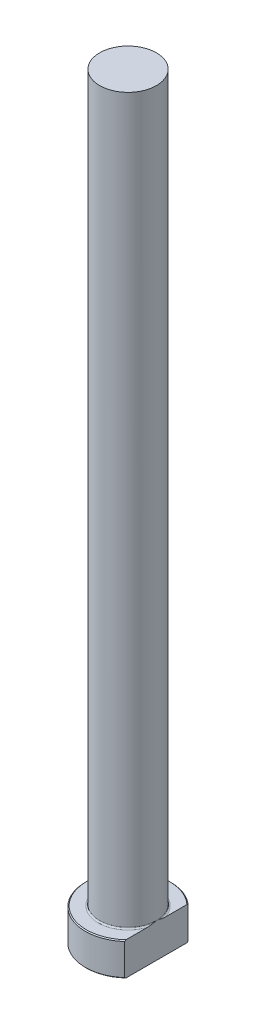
ISO-10303-21;
HEADER;
FILE_DESCRIPTION(('STEP AP214'),'2;1');
FILE_NAME('part.step','',(''),(''),'','','');
FILE_SCHEMA(('AUTOMOTIVE_DESIGN { 1 0 10303 214 1 1 1 1 }'));
ENDSEC;
DATA;
#1=APPLICATION_CONTEXT('core data for automotive mechanical design processes');
#2=APPLICATION_PROTOCOL_DEFINITION('international standard','automotive_design',2000,#1);
#3=PRODUCT_CONTEXT('',#1,'mechanical');
#4=PRODUCT('Part','Part','',(#3));
#5=PRODUCT_RELATED_PRODUCT_CATEGORY('part','',(#4));
#6=PRODUCT_DEFINITION_FORMATION('','',#4);
#7=PRODUCT_DEFINITION_CONTEXT('part definition',#1,'design');
#8=PRODUCT_DEFINITION('design','',#6,#7);
#9=PRODUCT_DEFINITION_SHAPE('','',#8);
#10=(LENGTH_UNIT() NAMED_UNIT(*) SI_UNIT(.MILLI.,.METRE.));
#11=(NAMED_UNIT(*) PLANE_ANGLE_UNIT() SI_UNIT($,.RADIAN.));
#12=(NAMED_UNIT(*) SI_UNIT($,.STERADIAN.) SOLID_ANGLE_UNIT());
#13=UNCERTAINTY_MEASURE_WITH_UNIT(LENGTH_MEASURE(1.E-05),#10,'distance_accuracy_value','');
#14=(GEOMETRIC_REPRESENTATION_CONTEXT(3) GLOBAL_UNCERTAINTY_ASSIGNED_CONTEXT((#13)) GLOBAL_UNIT_ASSIGNED_CONTEXT((#10,
#11,#12)) REPRESENTATION_CONTEXT('',''));
#15=CARTESIAN_POINT('',(0.,0.,0.));
#16=DIRECTION('',(0.,0.,1.));
#17=DIRECTION('',(1.,0.,0.));
#18=AXIS2_PLACEMENT_3D('',#15,#16,#17);
#19=CARTESIAN_POINT('',(0.,0.,0.));
#20=DIRECTION('',(0.,-1.,0.));
#21=DIRECTION('',(0.,0.,-1.));
#22=AXIS2_PLACEMENT_3D('',#19,#20,#21);
#23=PLANE('',#22);
#24=CARTESIAN_POINT('',(0.,0.,0.));
#25=DIRECTION('',(0.,-1.,0.));
#26=DIRECTION('',(0.,0.,-1.));
#27=AXIS2_PLACEMENT_3D('',#24,#25,#26);
#28=CIRCLE('',#27,8.79999999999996);
#29=CARTESIAN_POINT('',(5.99999999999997,0.,6.4373907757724));
#30=VERTEX_POINT('',#29);
#31=CARTESIAN_POINT('',(5.99999999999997,0.,-6.4373907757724));
#32=VERTEX_POINT('',#31);
#33=EDGE_CURVE('E98',#30,#32,#28,.T.);
#34=ORIENTED_EDGE('',*,*,#33,.T.);
#35=DIRECTION('',(0.,0.,1.));
#36=VECTOR('',#35,1.);
#37=CARTESIAN_POINT('',(5.99999999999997,0.,-6.70820393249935));
#38=LINE('',#37,#36);
#39=EDGE_CURVE('E83',#32,#30,#38,.T.);
#40=ORIENTED_EDGE('',*,*,#39,.T.);
#41=EDGE_LOOP('',(#34,#40));
#42=FACE_BOUND('',#41,.T.);
#43=ADVANCED_FACE('F32',(#42),#23,.T.);
#44=CARTESIAN_POINT('',(0.,259.958771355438,0.));
#45=DIRECTION('',(0.,1.,0.));
#46=DIRECTION('',(0.,0.,1.));
#47=AXIS2_PLACEMENT_3D('',#44,#45,#46);
#48=CYLINDRICAL_SURFACE('',#47,8.99999999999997);
#49=CARTESIAN_POINT('',(0.,6.80000000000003,0.));
#50=DIRECTION('',(0.,1.,0.));
#51=DIRECTION('',(0.,0.,1.));
#52=AXIS2_PLACEMENT_3D('',#49,#50,#51);
#53=CIRCLE('',#52,8.99999999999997);
#54=CARTESIAN_POINT('',(5.99999999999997,6.80000000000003,6.70820393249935));
#55=VERTEX_POINT('',#54);
#56=CARTESIAN_POINT('',(5.99999999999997,6.80000000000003,-6.70820393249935));
#57=VERTEX_POINT('',#56);
#58=EDGE_CURVE('E104',#55,#57,#53,.F.);
#59=ORIENTED_EDGE('',*,*,#58,.T.);
#60=DIRECTION('',(0.,-1.,0.));
#61=VECTOR('',#60,1.);
#62=CARTESIAN_POINT('',(5.99999999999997,160.,-6.70820393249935));
#63=LINE('',#62,#61);
#64=CARTESIAN_POINT('',(5.99999999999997,0.199999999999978,-6.70820393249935));
#65=VERTEX_POINT('',#64);
#66=EDGE_CURVE('E183',#57,#65,#63,.T.);
#67=ORIENTED_EDGE('',*,*,#66,.T.);
#68=CARTESIAN_POINT('',(0.,0.199999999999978,0.));
#69=DIRECTION('',(0.,-1.,0.));
#70=DIRECTION('',(0.,0.,-1.));
#71=AXIS2_PLACEMENT_3D('',#68,#69,#70);
#72=CIRCLE('',#71,8.99999999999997);
#73=CARTESIAN_POINT('',(5.99999999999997,0.199999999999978,6.70820393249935));
#74=VERTEX_POINT('',#73);
#75=EDGE_CURVE('E100',#65,#74,#72,.F.);
#76=ORIENTED_EDGE('',*,*,#75,.T.);
#77=DIRECTION('',(0.,-1.,0.));
#78=VECTOR('',#77,1.);
#79=CARTESIAN_POINT('',(5.99999999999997,160.,6.70820393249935));
#80=LINE('',#79,#78);
#81=EDGE_CURVE('E93',#55,#74,#80,.T.);
#82=ORIENTED_EDGE('',*,*,#81,.F.);
#83=EDGE_LOOP('',(#59,#67,#76,#82));
#84=FACE_BOUND('',#83,.T.);
#85=ADVANCED_FACE('F158',(#84),#48,.T.);
#86=CARTESIAN_POINT('',(-8.99999999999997,7.,0.));
#87=DIRECTION('',(0.,1.,0.));
#88=DIRECTION('',(0.,0.,1.));
#89=AXIS2_PLACEMENT_3D('',#86,#87,#88);
#90=PLANE('',#89);
#91=CARTESIAN_POINT('',(0.,7.,0.));
#92=DIRECTION('',(0.,1.,0.));
#93=DIRECTION('',(0.,0.,1.));
#94=AXIS2_PLACEMENT_3D('',#91,#92,#93);
#95=CIRCLE('',#94,8.79999999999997);
#96=CARTESIAN_POINT('',(5.99999999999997,7.,-6.43739077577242));
#97=VERTEX_POINT('',#96);
#98=CARTESIAN_POINT('',(5.99999999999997,7.,6.43739077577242));
#99=VERTEX_POINT('',#98);
#100=EDGE_CURVE('E178',#97,#99,#95,.T.);
#101=ORIENTED_EDGE('',*,*,#100,.T.);
#102=DIRECTION('',(0.,0.,-1.));
#103=VECTOR('',#102,1.);
#104=CARTESIAN_POINT('',(5.99999999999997,7.,0.));
#105=LINE('',#104,#103);
#106=CARTESIAN_POINT('',(5.99999999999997,6.99999999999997,1.92093727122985));
#107=VERTEX_POINT('',#106);
#108=EDGE_CURVE('E57',#99,#107,#105,.T.);
#109=ORIENTED_EDGE('',*,*,#108,.T.);
#110=CARTESIAN_POINT('',(0.,7.,0.));
#111=DIRECTION('',(0.,1.,0.));
#112=DIRECTION('',(0.,0.,1.));
#113=AXIS2_PLACEMENT_3D('',#110,#111,#112);
#114=CIRCLE('',#113,6.29999999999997);
#115=CARTESIAN_POINT('',(5.99999999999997,6.99999999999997,-1.92093727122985));
#116=VERTEX_POINT('',#115);
#117=EDGE_CURVE('E107',#107,#116,#114,.F.);
#118=ORIENTED_EDGE('',*,*,#117,.T.);
#119=EDGE_CURVE('E136',#116,#97,#105,.T.);
#120=ORIENTED_EDGE('',*,*,#119,.T.);
#121=EDGE_LOOP('',(#101,#109,#118,#120));
#122=FACE_BOUND('',#121,.T.);
#123=ADVANCED_FACE('F147',(#122),#90,.T.);
#124=CARTESIAN_POINT('',(0.,7.00000000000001,0.));
#125=DIRECTION('',(0.,-1.,0.));
#126=DIRECTION('',(0.,0.,-1.));
#127=AXIS2_PLACEMENT_3D('',#124,#125,#126);
#128=CONICAL_SURFACE('',#127,8.79999999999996,0.785398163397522);
#129=ORIENTED_EDGE('',*,*,#58,.F.);
#130=CARTESIAN_POINT('',(5.99999999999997,-0.132115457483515,14.7591430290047));
#131=CARTESIAN_POINT('',(5.99999999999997,0.0733919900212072,14.537299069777));
#132=CARTESIAN_POINT('',(5.99999999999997,0.278550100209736,14.3151315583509));
#133=CARTESIAN_POINT('',(5.99999999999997,0.688060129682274,13.8700519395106));
#134=CARTESIAN_POINT('',(5.99999999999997,0.89241204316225,13.647139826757));
#135=CARTESIAN_POINT('',(5.99999999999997,1.50418032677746,12.9770492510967));
#136=CARTESIAN_POINT('',(5.99999999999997,1.91022091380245,12.5286117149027));
#137=CARTESIAN_POINT('',(5.99999999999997,2.71980134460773,11.6246427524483));
#138=CARTESIAN_POINT('',(5.99999999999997,3.12331180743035,11.1690849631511));
#139=CARTESIAN_POINT('',(5.99999999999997,3.9234152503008,10.2520077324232));
#140=CARTESIAN_POINT('',(5.99999999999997,4.32000903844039,9.79048899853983));
#141=CARTESIAN_POINT('',(5.99999999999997,5.02478816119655,8.95241885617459));
#142=CARTESIAN_POINT('',(5.99999999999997,5.33476112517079,8.5773777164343));
#143=CARTESIAN_POINT('',(5.99999999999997,5.79310598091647,8.00939108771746));
#144=CARTESIAN_POINT('',(5.99999999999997,5.94480562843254,7.81913145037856));
#145=CARTESIAN_POINT('',(5.99999999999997,6.2455365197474,7.43651727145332));
#146=CARTESIAN_POINT('',(5.99999999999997,6.39456781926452,7.24416277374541));
#147=CARTESIAN_POINT('',(5.99999999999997,6.68925367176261,6.85721540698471));
#148=CARTESIAN_POINT('',(5.99999999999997,6.8349117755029,6.66262524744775));
#149=CARTESIAN_POINT('',(5.99999999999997,7.12230719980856,6.27057707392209));
#150=CARTESIAN_POINT('',(5.99999999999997,7.26404470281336,6.07311919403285));
#151=CARTESIAN_POINT('',(5.99999999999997,7.54263362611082,5.67488713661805));
#152=CARTESIAN_POINT('',(5.99999999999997,7.6794868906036,5.47411425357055));
#153=CARTESIAN_POINT('',(5.99999999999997,7.94714213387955,5.06858845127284));
#154=CARTESIAN_POINT('',(5.99999999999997,8.07794479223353,4.86383598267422));
#155=CARTESIAN_POINT('',(5.99999999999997,8.32827993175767,4.45554322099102));
#156=CARTESIAN_POINT('',(5.99999999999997,8.44802771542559,4.2521356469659));
#157=CARTESIAN_POINT('',(5.99999999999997,8.67837972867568,3.84013730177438));
#158=CARTESIAN_POINT('',(5.99999999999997,8.78898293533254,3.63154595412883));
#159=CARTESIAN_POINT('',(5.99999999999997,8.99840984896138,3.20863811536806));
#160=CARTESIAN_POINT('',(5.99999999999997,9.09724073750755,2.99432521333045));
#161=CARTESIAN_POINT('',(5.99999999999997,9.27991776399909,2.55937061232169));
#162=CARTESIAN_POINT('',(5.99999999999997,9.36376811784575,2.33873071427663));
#163=CARTESIAN_POINT('',(5.99999999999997,9.4962773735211,1.94012294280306));
#164=CARTESIAN_POINT('',(5.99999999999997,9.5486217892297,1.76338731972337));
#165=CARTESIAN_POINT('',(5.99999999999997,9.63978035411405,1.40643307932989));
#166=CARTESIAN_POINT('',(5.99999999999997,9.678596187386,1.22621489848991));
#167=CARTESIAN_POINT('',(5.99999999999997,9.74077317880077,0.863704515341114));
#168=CARTESIAN_POINT('',(5.99999999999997,9.76418479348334,0.681421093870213));
#169=CARTESIAN_POINT('',(5.99999999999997,9.79447814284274,0.315473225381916));
#170=CARTESIAN_POINT('',(5.99999999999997,9.80136083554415,0.131808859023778));
#171=CARTESIAN_POINT('',(5.99999999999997,9.79818788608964,-0.235881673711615));
#172=CARTESIAN_POINT('',(5.99999999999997,9.78808514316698,-0.419907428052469));
#173=CARTESIAN_POINT('',(5.99999999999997,9.75144464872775,-0.786302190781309));
#174=CARTESIAN_POINT('',(5.99999999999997,9.72490559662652,-0.968671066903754));
#175=CARTESIAN_POINT('',(5.99999999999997,9.65670736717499,-1.33110767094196));
#176=CARTESIAN_POINT('',(5.99999999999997,9.61500120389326,-1.51116642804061));
#177=CARTESIAN_POINT('',(5.99999999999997,9.51838325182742,-1.86766519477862));
#178=CARTESIAN_POINT('',(5.99999999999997,9.46347085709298,-2.04410503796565));
#179=CARTESIAN_POINT('',(5.99999999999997,9.3356365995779,-2.41270922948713));
#180=CARTESIAN_POINT('',(5.99999999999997,9.26138327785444,-2.60440790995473));
#181=CARTESIAN_POINT('',(5.99999999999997,9.10155310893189,-2.9830649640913));
#182=CARTESIAN_POINT('',(5.99999999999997,9.01597146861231,-3.17002129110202));
#183=CARTESIAN_POINT('',(5.99999999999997,8.83553473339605,-3.53975380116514));
#184=CARTESIAN_POINT('',(5.99999999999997,8.74066449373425,-3.72252253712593));
#185=CARTESIAN_POINT('',(5.99999999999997,8.54355472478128,-4.08398624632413));
#186=CARTESIAN_POINT('',(5.99999999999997,8.44131612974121,-4.26268173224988));
#187=CARTESIAN_POINT('',(5.99999999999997,8.22953960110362,-4.61872309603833));
#188=CARTESIAN_POINT('',(5.99999999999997,8.11992610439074,-4.79602381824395));
#189=CARTESIAN_POINT('',(5.99999999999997,7.89571048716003,-5.14743548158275));
#190=CARTESIAN_POINT('',(5.99999999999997,7.78110825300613,-5.32154634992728));
#191=CARTESIAN_POINT('',(5.99999999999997,7.54792782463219,-5.66682327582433));
#192=CARTESIAN_POINT('',(5.99999999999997,7.42935372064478,-5.8379921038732));
#193=CARTESIAN_POINT('',(5.99999999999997,7.18881616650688,-6.17793707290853));
#194=CARTESIAN_POINT('',(5.99999999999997,7.06685256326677,-6.34671310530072));
#195=CARTESIAN_POINT('',(5.99999999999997,6.80539778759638,-6.70216781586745));
#196=CARTESIAN_POINT('',(5.99999999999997,6.66554966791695,-6.88858356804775));
#197=CARTESIAN_POINT('',(5.99999999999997,6.38292065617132,-7.25918139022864));
#198=CARTESIAN_POINT('',(5.99999999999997,6.24013967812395,-7.44336339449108));
#199=CARTESIAN_POINT('',(5.99999999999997,5.80812002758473,-7.99307414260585));
#200=CARTESIAN_POINT('',(5.99999999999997,5.51523002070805,-8.35573349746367));
#201=CARTESIAN_POINT('',(5.99999999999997,4.92224619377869,-9.07562940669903));
#202=CARTESIAN_POINT('',(5.99999999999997,4.62214609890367,-9.43286076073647));
#203=CARTESIAN_POINT('',(5.99999999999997,4.01677382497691,-10.1429201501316));
#204=CARTESIAN_POINT('',(5.99999999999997,3.71150152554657,-10.4957480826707));
#205=CARTESIAN_POINT('',(5.99999999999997,3.11456796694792,-11.1779164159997));
#206=CARTESIAN_POINT('',(5.99999999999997,2.82312451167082,-11.5074478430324));
#207=CARTESIAN_POINT('',(5.99999999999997,2.23747184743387,-12.1640528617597));
#208=CARTESIAN_POINT('',(5.99999999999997,1.94326258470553,-12.4911264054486));
#209=CARTESIAN_POINT('',(5.99999999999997,1.35320776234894,-13.1426363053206));
#210=CARTESIAN_POINT('',(5.99999999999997,1.05736649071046,-13.4670765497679));
#211=CARTESIAN_POINT('',(5.99999999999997,0.463882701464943,-14.1142803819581));
#212=CARTESIAN_POINT('',(5.99999999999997,0.166240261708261,-14.4370440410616));
#213=CARTESIAN_POINT('',(5.99999999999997,-0.132115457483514,-14.7591430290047));
#214=B_SPLINE_CURVE_WITH_KNOTS('',3,(#130,#131,#132,#133,#134,#135,#136,#137,#138,#139,#140,
#141,#142,#143,#144,#145,#146,#147,#148,#149,#150,#151,#152,#153,#154,#155,#156,#157,#158,#159,
#160,#161,#162,#163,#164,#165,#166,#167,#168,#169,#170,#171,#172,#173,#174,#175,#176,#177,#178,
#179,#180,#181,#182,#183,#184,#185,#186,#187,#188,#189,#190,#191,#192,#193,#194,#195,#196,#197,
#198,#199,#200,#201,#202,#203,#204,#205,#206,#207,#208,#209,#210,#211,#212,#213),.UNSPECIFIED.,
.F.,.F.,(4,2,2,2,2,2,2,2,2,2,2,2,2,2,2,2,2,2,2,2,2,2,2,2,2,2,2,2,2,2,2,2,2,2,2,2,2,2,2,2,2,4),
(0.,0.907210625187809,1.81442776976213,3.62925156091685,5.45490487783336,7.28034345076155,
8.73990838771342,9.46989218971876,10.1998607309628,10.929022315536,11.6581499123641,
12.3869992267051,13.1157664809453,13.8236973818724,14.5317073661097,15.2392832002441,
15.9466595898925,16.4991819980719,17.0516356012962,17.6022705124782,18.1528735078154,
18.7050058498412,19.2571818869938,19.8110832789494,20.3650100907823,20.9812908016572,
21.5978331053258,22.2153979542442,22.8328846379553,23.4581285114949,24.0833866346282,
24.7080195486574,25.3326807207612,26.0317691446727,26.7308780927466,28.1292235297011,
29.5288334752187,30.9284760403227,32.2482200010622,33.5679896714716,34.8851960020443,
36.2023458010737),.UNSPECIFIED.);
#215=EDGE_CURVE('E135',#55,#99,#214,.T.);
#216=ORIENTED_EDGE('',*,*,#215,.T.);
#217=ORIENTED_EDGE('',*,*,#100,.F.);
#218=EDGE_CURVE('E127',#97,#57,#214,.T.);
#219=ORIENTED_EDGE('',*,*,#218,.T.);
#220=EDGE_LOOP('',(#129,#216,#217,#219));
#221=FACE_BOUND('',#220,.T.);
#222=ADVANCED_FACE('F143',(#221),#128,.T.);
#223=CARTESIAN_POINT('',(0.,0.199999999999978,0.));
#224=DIRECTION('',(0.,1.,0.));
#225=DIRECTION('',(0.,0.,1.));
#226=AXIS2_PLACEMENT_3D('',#223,#224,#225);
#227=CONICAL_SURFACE('',#226,8.99999999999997,0.785398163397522);
#228=ORIENTED_EDGE('',*,*,#75,.F.);
#229=CARTESIAN_POINT('',(5.99999999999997,7.13211545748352,-14.7591430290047));
#230=CARTESIAN_POINT('',(5.99999999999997,6.9266080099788,-14.537299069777));
#231=CARTESIAN_POINT('',(5.99999999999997,6.72144989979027,-14.3151315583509));
#232=CARTESIAN_POINT('',(5.99999999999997,6.31193987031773,-13.8700519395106));
#233=CARTESIAN_POINT('',(5.99999999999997,6.10758795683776,-13.647139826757));
#234=CARTESIAN_POINT('',(5.99999999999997,5.49581967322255,-12.9770492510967));
#235=CARTESIAN_POINT('',(5.99999999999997,5.08977908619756,-12.5286117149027));
#236=CARTESIAN_POINT('',(5.99999999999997,4.28019865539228,-11.6246427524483));
#237=CARTESIAN_POINT('',(5.99999999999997,3.87668819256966,-11.1690849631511));
#238=CARTESIAN_POINT('',(5.99999999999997,3.0765847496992,-10.2520077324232));
#239=CARTESIAN_POINT('',(5.99999999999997,2.67999096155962,-9.79048899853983));
#240=CARTESIAN_POINT('',(5.99999999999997,1.97521183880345,-8.95241885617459));
#241=CARTESIAN_POINT('',(5.99999999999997,1.66523887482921,-8.5773777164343));
#242=CARTESIAN_POINT('',(5.99999999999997,1.20689401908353,-8.00939108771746));
#243=CARTESIAN_POINT('',(5.99999999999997,1.05519437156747,-7.81913145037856));
#244=CARTESIAN_POINT('',(5.99999999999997,0.754463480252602,-7.43651727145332));
#245=CARTESIAN_POINT('',(5.99999999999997,0.605432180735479,-7.2441627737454));
#246=CARTESIAN_POINT('',(5.99999999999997,0.310746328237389,-6.8572154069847));
#247=CARTESIAN_POINT('',(5.99999999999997,0.1650882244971,-6.66262524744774));
#248=CARTESIAN_POINT('',(5.99999999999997,-0.122307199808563,-6.27057707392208));
#249=CARTESIAN_POINT('',(5.99999999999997,-0.264044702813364,-6.07311919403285));
#250=CARTESIAN_POINT('',(5.99999999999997,-0.542633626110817,-5.67488713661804));
#251=CARTESIAN_POINT('',(5.99999999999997,-0.679486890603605,-5.47411425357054));
#252=CARTESIAN_POINT('',(5.99999999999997,-0.947142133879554,-5.06858845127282));
#253=CARTESIAN_POINT('',(5.99999999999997,-1.07794479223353,-4.86383598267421));
#254=CARTESIAN_POINT('',(5.99999999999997,-1.32827993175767,-4.45554322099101));
#255=CARTESIAN_POINT('',(5.99999999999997,-1.44802771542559,-4.25213564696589));
#256=CARTESIAN_POINT('',(5.99999999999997,-1.67837972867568,-3.84013730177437));
#257=CARTESIAN_POINT('',(5.99999999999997,-1.78898293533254,-3.63154595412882));
#258=CARTESIAN_POINT('',(5.99999999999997,-1.99840984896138,-3.20863811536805));
#259=CARTESIAN_POINT('',(5.99999999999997,-2.09724073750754,-2.99432521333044));
#260=CARTESIAN_POINT('',(5.99999999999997,-2.27991776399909,-2.55937061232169));
#261=CARTESIAN_POINT('',(5.99999999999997,-2.36376811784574,-2.33873071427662));
#262=CARTESIAN_POINT('',(5.99999999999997,-2.4962773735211,-1.94012294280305));
#263=CARTESIAN_POINT('',(5.99999999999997,-2.5486217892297,-1.76338731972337));
#264=CARTESIAN_POINT('',(5.99999999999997,-2.63978035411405,-1.40643307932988));
#265=CARTESIAN_POINT('',(5.99999999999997,-2.67859618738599,-1.2262148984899));
#266=CARTESIAN_POINT('',(5.99999999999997,-2.74077317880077,-0.863704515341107));
#267=CARTESIAN_POINT('',(5.99999999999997,-2.76418479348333,-0.681421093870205));
#268=CARTESIAN_POINT('',(5.99999999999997,-2.79447814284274,-0.315473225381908));
#269=CARTESIAN_POINT('',(5.99999999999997,-2.80136083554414,-0.131808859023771));
#270=CARTESIAN_POINT('',(5.99999999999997,-2.79818788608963,0.235881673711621));
#271=CARTESIAN_POINT('',(5.99999999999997,-2.78808514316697,0.419907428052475));
#272=CARTESIAN_POINT('',(5.99999999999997,-2.75144464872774,0.786302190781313));
#273=CARTESIAN_POINT('',(5.99999999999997,-2.72490559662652,0.968671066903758));
#274=CARTESIAN_POINT('',(5.99999999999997,-2.65670736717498,1.33110767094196));
#275=CARTESIAN_POINT('',(5.99999999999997,-2.61500120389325,1.51116642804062));
#276=CARTESIAN_POINT('',(5.99999999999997,-2.51838325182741,1.86766519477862));
#277=CARTESIAN_POINT('',(5.99999999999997,-2.46347085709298,2.04410503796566));
#278=CARTESIAN_POINT('',(5.99999999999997,-2.33563659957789,2.41270922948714));
#279=CARTESIAN_POINT('',(5.99999999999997,-2.26138327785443,2.60440790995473));
#280=CARTESIAN_POINT('',(5.99999999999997,-2.10155310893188,2.98306496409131));
#281=CARTESIAN_POINT('',(5.99999999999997,-2.0159714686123,3.17002129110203));
#282=CARTESIAN_POINT('',(5.99999999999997,-1.83553473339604,3.53975380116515));
#283=CARTESIAN_POINT('',(5.99999999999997,-1.74066449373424,3.72252253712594));
#284=CARTESIAN_POINT('',(5.99999999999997,-1.54355472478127,4.08398624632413));
#285=CARTESIAN_POINT('',(5.99999999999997,-1.4413161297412,4.26268173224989));
#286=CARTESIAN_POINT('',(5.99999999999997,-1.22953960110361,4.61872309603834));
#287=CARTESIAN_POINT('',(5.99999999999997,-1.11992610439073,4.79602381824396));
#288=CARTESIAN_POINT('',(5.99999999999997,-0.89571048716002,5.14743548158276));
#289=CARTESIAN_POINT('',(5.99999999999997,-0.781108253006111,5.32154634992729));
#290=CARTESIAN_POINT('',(5.99999999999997,-0.547927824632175,5.66682327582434));
#291=CARTESIAN_POINT('',(5.99999999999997,-0.429353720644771,5.83799210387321));
#292=CARTESIAN_POINT('',(5.99999999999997,-0.188816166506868,6.17793707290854));
#293=CARTESIAN_POINT('',(5.99999999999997,-0.0668525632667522,6.34671310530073));
#294=CARTESIAN_POINT('',(5.99999999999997,0.194602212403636,6.70216781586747));
#295=CARTESIAN_POINT('',(5.99999999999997,0.334450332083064,6.88858356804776));
#296=CARTESIAN_POINT('',(5.99999999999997,0.617079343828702,7.25918139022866));
#297=CARTESIAN_POINT('',(5.99999999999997,0.759860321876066,7.4433633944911));
#298=CARTESIAN_POINT('',(5.99999999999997,1.19187997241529,7.99307414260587));
#299=CARTESIAN_POINT('',(5.99999999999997,1.48476997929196,8.35573349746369));
#300=CARTESIAN_POINT('',(5.99999999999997,2.07775380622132,9.07562940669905));
#301=CARTESIAN_POINT('',(5.99999999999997,2.37785390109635,9.43286076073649));
#302=CARTESIAN_POINT('',(5.99999999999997,2.98322617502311,10.1429201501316));
#303=CARTESIAN_POINT('',(5.99999999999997,3.28849847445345,10.4957480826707));
#304=CARTESIAN_POINT('',(5.99999999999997,3.8854320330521,11.1779164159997));
#305=CARTESIAN_POINT('',(5.99999999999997,4.1768754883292,11.5074478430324));
#306=CARTESIAN_POINT('',(5.99999999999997,4.76252815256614,12.1640528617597));
#307=CARTESIAN_POINT('',(5.99999999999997,5.05673741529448,12.4911264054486));
#308=CARTESIAN_POINT('',(5.99999999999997,5.64679223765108,13.1426363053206));
#309=CARTESIAN_POINT('',(5.99999999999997,5.94263350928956,13.4670765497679));
#310=CARTESIAN_POINT('',(5.99999999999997,6.53611729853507,14.1142803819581));
#311=CARTESIAN_POINT('',(5.99999999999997,6.83375973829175,14.4370440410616));
#312=CARTESIAN_POINT('',(5.99999999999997,7.13211545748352,14.7591430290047));
#313=B_SPLINE_CURVE_WITH_KNOTS('',3,(#229,#230,#231,#232,#233,#234,#235,#236,#237,#238,#239,
#240,#241,#242,#243,#244,#245,#246,#247,#248,#249,#250,#251,#252,#253,#254,#255,#256,#257,#258,
#259,#260,#261,#262,#263,#264,#265,#266,#267,#268,#269,#270,#271,#272,#273,#274,#275,#276,#277,
#278,#279,#280,#281,#282,#283,#284,#285,#286,#287,#288,#289,#290,#291,#292,#293,#294,#295,#296,
#297,#298,#299,#300,#301,#302,#303,#304,#305,#306,#307,#308,#309,#310,#311,#312),.UNSPECIFIED.,
.F.,.F.,(4,2,2,2,2,2,2,2,2,2,2,2,2,2,2,2,2,2,2,2,2,2,2,2,2,2,2,2,2,2,2,2,2,2,2,2,2,2,2,2,2,4),
(0.,0.907210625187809,1.81442776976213,3.62925156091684,5.45490487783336,7.28034345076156,
8.73990838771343,9.46989218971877,10.1998607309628,10.929022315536,11.6581499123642,
12.3869992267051,13.1157664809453,13.8236973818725,14.5317073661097,15.2392832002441,
15.9466595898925,16.4991819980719,17.0516356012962,17.6022705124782,18.1528735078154,
18.7050058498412,19.2571818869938,19.8110832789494,20.3650100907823,20.9812908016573,
21.5978331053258,22.2153979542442,22.8328846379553,23.4581285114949,24.0833866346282,
24.7080195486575,25.3326807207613,26.0317691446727,26.7308780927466,28.1292235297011,
29.5288334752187,30.9284760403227,32.2482200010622,33.5679896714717,34.8851960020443,
36.2023458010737),.UNSPECIFIED.);
#314=EDGE_CURVE('E86',#65,#32,#313,.T.);
#315=ORIENTED_EDGE('',*,*,#314,.T.);
#316=ORIENTED_EDGE('',*,*,#33,.F.);
#317=EDGE_CURVE('E89',#30,#74,#313,.T.);
#318=ORIENTED_EDGE('',*,*,#317,.T.);
#319=EDGE_LOOP('',(#228,#315,#316,#318));
#320=FACE_BOUND('',#319,.T.);
#321=ADVANCED_FACE('F97',(#320),#227,.T.);
#322=CARTESIAN_POINT('',(0.,7.29999999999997,0.));
#323=DIRECTION('',(0.,1.,0.));
#324=DIRECTION('',(0.,0.,1.));
#325=AXIS2_PLACEMENT_3D('',#322,#323,#324);
#326=TOROIDAL_SURFACE('',#325,6.29999999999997,0.3);
#327=CARTESIAN_POINT('',(5.99999999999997,7.29999999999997,0.));
#328=CARTESIAN_POINT('',(5.99999999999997,7.30000062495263,1.34604287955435E-10));
#329=CARTESIAN_POINT('',(5.99999999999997,7.30000124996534,-2.85495107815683E-07));
#330=CARTESIAN_POINT('',(5.99999999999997,7.30000241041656,-1.04928090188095E-06));
#331=CARTESIAN_POINT('',(5.99999999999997,7.30000292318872,-1.54785170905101E-06));
#332=CARTESIAN_POINT('',(5.99999999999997,7.30000401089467,-2.74944383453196E-06));
#333=CARTESIAN_POINT('',(5.99999999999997,7.30000456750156,-3.47196539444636E-06));
#334=CARTESIAN_POINT('',(5.99999999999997,7.30000554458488,-4.95172582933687E-06));
#335=CARTESIAN_POINT('',(5.99999999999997,7.30000596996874,-5.70604365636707E-06));
#336=CARTESIAN_POINT('',(5.99999999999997,7.30000759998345,-8.69525109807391E-06));
#337=CARTESIAN_POINT('',(5.99999999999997,7.30000872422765,-1.0978182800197E-05));
#338=CARTESIAN_POINT('',(5.99999999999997,7.30001052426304,-1.54456346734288E-05));
#339=CARTESIAN_POINT('',(5.99999999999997,7.3000112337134,-1.76170762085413E-05));
#340=CARTESIAN_POINT('',(5.99999999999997,7.30001429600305,-2.69928123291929E-05));
#341=CARTESIAN_POINT('',(5.99999999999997,7.30001664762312,-3.42000265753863E-05));
#342=CARTESIAN_POINT('',(5.99999999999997,7.30002002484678,-4.76829001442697E-05));
#343=CARTESIAN_POINT('',(5.99999999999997,7.30002120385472,-5.39195609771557E-05));
#344=CARTESIAN_POINT('',(5.99999999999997,7.30002992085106,-0.000100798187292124));
#345=CARTESIAN_POINT('',(5.99999999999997,7.30003667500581,-0.00014152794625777));
#346=CARTESIAN_POINT('',(5.99999999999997,7.30006623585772,-0.000303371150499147));
#347=CARTESIAN_POINT('',(5.99999999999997,7.30009428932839,-0.000423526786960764));
#348=CARTESIAN_POINT('',(5.99999999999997,7.30020425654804,-0.000901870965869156));
#349=CARTESIAN_POINT('',(5.99999999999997,7.3002828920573,-0.00126055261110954));
#350=CARTESIAN_POINT('',(5.99999999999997,7.30059934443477,-0.0026940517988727));
#351=CARTESIAN_POINT('',(5.99999999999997,7.3008413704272,-0.0037682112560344));
#352=CARTESIAN_POINT('',(5.99999999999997,7.30185255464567,-0.0082672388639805));
#353=CARTESIAN_POINT('',(5.99999999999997,7.30261638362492,-0.0116929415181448));
#354=CARTESIAN_POINT('',(5.99999999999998,7.30945824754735,-0.0423635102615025));
#355=CARTESIAN_POINT('',(5.99999999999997,7.31555811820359,-0.0696050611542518));
#356=CARTESIAN_POINT('',(5.99999999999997,7.32747716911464,-0.122985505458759));
#357=CARTESIAN_POINT('',(5.99999999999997,7.33329766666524,-0.149124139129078));
#358=CARTESIAN_POINT('',(5.99999999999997,7.34565922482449,-0.204790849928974));
#359=CARTESIAN_POINT('',(5.99999999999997,7.352196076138,-0.234319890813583));
#360=CARTESIAN_POINT('',(5.99999999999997,7.36527652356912,-0.29372170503));
#361=CARTESIAN_POINT('',(5.99999999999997,7.37181938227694,-0.323594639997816));
#362=CARTESIAN_POINT('',(5.99999999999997,7.38741819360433,-0.395325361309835));
#363=CARTESIAN_POINT('',(5.99999999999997,7.39643140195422,-0.437192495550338));
#364=CARTESIAN_POINT('',(5.99999999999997,7.41397520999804,-0.519837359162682));
#365=CARTESIAN_POINT('',(5.99999999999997,7.4225122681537,-0.560613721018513));
#366=CARTESIAN_POINT('',(5.99999999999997,7.45005469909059,-0.694529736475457));
#367=CARTESIAN_POINT('',(5.99999999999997,7.46845270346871,-0.787796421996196));
#368=CARTESIAN_POINT('',(5.99999999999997,7.50309772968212,-0.975673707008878));
#369=CARTESIAN_POINT('',(5.99999999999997,7.51932210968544,-1.07028855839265));
#370=CARTESIAN_POINT('',(5.99999999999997,7.54979671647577,-1.26922112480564));
#371=CARTESIAN_POINT('',(5.99999999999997,7.56370439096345,-1.37359247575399));
#372=CARTESIAN_POINT('',(5.99999999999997,7.58567213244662,-1.58267692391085));
#373=CARTESIAN_POINT('',(5.99999999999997,7.59375049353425,-1.68738790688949));
#374=CARTESIAN_POINT('',(5.99999999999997,7.59943466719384,-1.8430899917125));
#375=CARTESIAN_POINT('',(5.99999999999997,7.60029184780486,-1.89396002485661));
#376=CARTESIAN_POINT('',(5.99999999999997,7.5995288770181,-1.99574511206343));
#377=CARTESIAN_POINT('',(5.99999999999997,7.59790613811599,-2.04666015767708));
#378=CARTESIAN_POINT('',(5.99999999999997,7.59158346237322,-2.14740525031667));
#379=CARTESIAN_POINT('',(5.99999999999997,7.58693864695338,-2.19723851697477));
#380=CARTESIAN_POINT('',(5.99999999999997,7.57369485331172,-2.29634018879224));
#381=CARTESIAN_POINT('',(5.99999999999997,7.56510170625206,-2.3456093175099));
#382=CARTESIAN_POINT('',(5.99999999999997,7.54513600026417,-2.43101613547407));
#383=CARTESIAN_POINT('',(5.99999999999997,7.53495732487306,-2.46741817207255));
#384=CARTESIAN_POINT('',(5.99999999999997,7.5163599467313,-2.52083307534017));
#385=CARTESIAN_POINT('',(5.99999999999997,7.50961541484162,-2.53842082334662));
#386=CARTESIAN_POINT('',(5.99999999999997,7.49476050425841,-2.57300282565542));
#387=CARTESIAN_POINT('',(5.99999999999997,7.48665036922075,-2.58999718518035));
#388=CARTESIAN_POINT('',(5.99999999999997,7.4656679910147,-2.62872971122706));
#389=CARTESIAN_POINT('',(5.99999999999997,7.45211281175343,-2.65012863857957));
#390=CARTESIAN_POINT('',(5.99999999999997,7.42848584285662,-2.67978235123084));
#391=CARTESIAN_POINT('',(5.99999999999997,7.42001211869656,-2.68929941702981));
#392=CARTESIAN_POINT('',(5.99999999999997,7.40175979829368,-2.70700164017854));
#393=CARTESIAN_POINT('',(5.99999999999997,7.39198420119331,-2.71518976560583));
#394=CARTESIAN_POINT('',(5.99999999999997,7.37475773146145,-2.7269570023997));
#395=CARTESIAN_POINT('',(5.99999999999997,7.36772137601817,-2.73113834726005));
#396=CARTESIAN_POINT('',(5.99999999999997,7.35309194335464,-2.73838811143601));
#397=CARTESIAN_POINT('',(5.99999999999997,7.34549938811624,-2.7414575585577));
#398=CARTESIAN_POINT('',(5.99999999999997,7.32979919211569,-2.74623687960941));
#399=CARTESIAN_POINT('',(5.99999999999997,7.32168697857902,-2.74793213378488));
#400=CARTESIAN_POINT('',(5.99999999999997,7.30528814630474,-2.74970225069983));
#401=CARTESIAN_POINT('',(5.99999999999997,7.29700168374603,-2.74977850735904));
#402=CARTESIAN_POINT('',(5.99999999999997,7.2816016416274,-2.74839814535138));
#403=CARTESIAN_POINT('',(5.99999999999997,7.27447007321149,-2.74713049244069));
#404=CARTESIAN_POINT('',(5.99999999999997,7.26050316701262,-2.74347158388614));
#405=CARTESIAN_POINT('',(5.99999999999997,7.25366802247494,-2.7410796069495));
#406=CARTESIAN_POINT('',(5.99999999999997,7.23783277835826,-2.73423902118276));
#407=CARTESIAN_POINT('',(5.99999999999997,7.22902314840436,-2.72935244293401));
#408=CARTESIAN_POINT('',(5.99999999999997,7.21228574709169,-2.7182516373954));
#409=CARTESIAN_POINT('',(5.99999999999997,7.20436026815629,-2.71203407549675));
#410=CARTESIAN_POINT('',(5.99999999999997,7.18433696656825,-2.69420240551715));
#411=CARTESIAN_POINT('',(5.99999999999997,7.17298706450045,-2.68175715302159));
#412=CARTESIAN_POINT('',(5.99999999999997,7.15219498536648,-2.65539556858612));
#413=CARTESIAN_POINT('',(5.99999999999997,7.14275658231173,-2.64147640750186));
#414=CARTESIAN_POINT('',(5.99999999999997,7.12508934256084,-2.61223187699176));
#415=CARTESIAN_POINT('',(5.99999999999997,7.11691464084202,-2.59687428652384));
#416=CARTESIAN_POINT('',(5.99999999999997,7.10186133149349,-2.56552911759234));
#417=CARTESIAN_POINT('',(5.99999999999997,7.09498416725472,-2.54954086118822));
#418=CARTESIAN_POINT('',(5.99999999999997,7.07586257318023,-2.50075322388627));
#419=CARTESIAN_POINT('',(5.99999999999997,7.06523495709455,-2.46732486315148));
#420=CARTESIAN_POINT('',(5.99999999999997,7.04175411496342,-2.38014114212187));
#421=CARTESIAN_POINT('',(5.99999999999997,7.0311656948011,-2.32580591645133));
#422=CARTESIAN_POINT('',(5.99999999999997,7.01502027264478,-2.21628778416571));
#423=CARTESIAN_POINT('',(5.99999999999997,7.00947977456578,-2.16110269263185));
#424=CARTESIAN_POINT('',(5.99999999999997,7.00227593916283,-2.05225433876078));
#425=CARTESIAN_POINT('',(5.99999999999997,7.00049528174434,-1.99859827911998));
#426=CARTESIAN_POINT('',(5.99999999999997,6.99968738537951,-1.89155586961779));
#427=CARTESIAN_POINT('',(5.99999999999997,7.00064591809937,-1.83816956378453));
#428=CARTESIAN_POINT('',(5.99999999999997,7.00516082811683,-1.72092619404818));
#429=CARTESIAN_POINT('',(5.99999999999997,7.0091939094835,-1.65708843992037));
#430=CARTESIAN_POINT('',(5.99999999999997,7.01973827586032,-1.52965474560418));
#431=CARTESIAN_POINT('',(5.99999999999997,7.02624848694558,-1.46605871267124));
#432=CARTESIAN_POINT('',(5.99999999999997,7.04143114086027,-1.33760082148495));
#433=CARTESIAN_POINT('',(5.99999999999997,7.05015116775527,-1.27274468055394));
#434=CARTESIAN_POINT('',(5.99999999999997,7.06927542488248,-1.14310871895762));
#435=CARTESIAN_POINT('',(5.99999999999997,7.07968406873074,-1.07832955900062));
#436=CARTESIAN_POINT('',(5.99999999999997,7.10594320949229,-0.924890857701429));
#437=CARTESIAN_POINT('',(5.99999999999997,7.12237584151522,-0.836331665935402));
#438=CARTESIAN_POINT('',(5.99999999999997,7.15676035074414,-0.660568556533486));
#439=CARTESIAN_POINT('',(5.99999999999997,7.17469265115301,-0.573360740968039));
#440=CARTESIAN_POINT('',(5.99999999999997,7.20946366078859,-0.409309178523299));
#441=CARTESIAN_POINT('',(5.99999999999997,7.22618667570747,-0.332440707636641));
#442=CARTESIAN_POINT('',(5.99999999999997,7.25202386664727,-0.215187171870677));
#443=CARTESIAN_POINT('',(5.99999999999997,7.26098977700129,-0.174768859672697));
#444=CARTESIAN_POINT('',(5.99999999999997,7.27885525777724,-0.0946083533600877));
#445=CARTESIAN_POINT('',(5.99999999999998,7.28775352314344,-0.0548658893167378));
#446=CARTESIAN_POINT('',(5.99999999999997,7.2973853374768,-0.0116849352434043));
#447=CARTESIAN_POINT('',(5.99999999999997,7.29815099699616,-0.0082512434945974));
#448=CARTESIAN_POINT('',(5.99999999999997,7.2991626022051,-0.00375043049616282));
#449=CARTESIAN_POINT('',(5.99999999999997,7.29940322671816,-0.00268247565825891));
#450=CARTESIAN_POINT('',(5.99999999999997,7.29971797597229,-0.0012566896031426));
#451=CARTESIAN_POINT('',(5.99999999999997,7.2997962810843,-0.000899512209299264));
#452=CARTESIAN_POINT('',(5.99999999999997,7.2999058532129,-0.000422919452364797));
#453=CARTESIAN_POINT('',(5.99999999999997,7.29993385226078,-0.000303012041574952));
#454=CARTESIAN_POINT('',(5.99999999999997,7.299963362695,-0.000141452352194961));
#455=CARTESIAN_POINT('',(5.99999999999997,7.29997011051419,-0.000100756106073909));
#456=CARTESIAN_POINT('',(5.99999999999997,7.29997881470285,-5.39118915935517E-05));
#457=CARTESIAN_POINT('',(5.99999999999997,7.29997999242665,-4.76769647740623E-05));
#458=CARTESIAN_POINT('',(5.99999999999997,7.29998336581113,-3.41977669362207E-05));
#459=CARTESIAN_POINT('',(5.99999999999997,7.29998571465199,-2.69924043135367E-05));
#460=CARTESIAN_POINT('',(5.99999999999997,7.29998877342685,-1.76186229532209E-05));
#461=CARTESIAN_POINT('',(5.99999999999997,7.29998948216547,-1.54473107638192E-05));
#462=CARTESIAN_POINT('',(5.99999999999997,7.29999128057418,-1.09800124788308E-05));
#463=CARTESIAN_POINT('',(5.99999999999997,7.29999240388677,-8.69708706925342E-06));
#464=CARTESIAN_POINT('',(5.99999999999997,7.29999403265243,-5.70776681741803E-06));
#465=CARTESIAN_POINT('',(5.99999999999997,7.29999445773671,-4.95337952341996E-06));
#466=CARTESIAN_POINT('',(5.99999999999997,7.29999543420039,-3.47342608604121E-06));
#467=CARTESIAN_POINT('',(5.99999999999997,7.29999599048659,-2.7507782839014E-06));
#468=CARTESIAN_POINT('',(5.99999999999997,7.29999707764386,-1.54889527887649E-06));
#469=CARTESIAN_POINT('',(5.99999999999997,7.29999759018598,-1.0501721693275E-06));
#470=CARTESIAN_POINT('',(5.99999999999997,7.29999875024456,-2.85992424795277E-07));
#471=CARTESIAN_POINT('',(5.99999999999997,7.29999937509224,-1.34594612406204E-10));
#472=CARTESIAN_POINT('',(5.99999999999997,7.29999999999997,0.));
#473=B_SPLINE_CURVE_WITH_KNOTS('',3,(#327,#328,#329,#330,#331,#332,#333,#334,#335,#336,#337,
#338,#339,#340,#341,#342,#343,#344,#345,#346,#347,#348,#349,#350,#351,#352,#353,#354,#355,#356,
#357,#358,#359,#360,#361,#362,#363,#364,#365,#366,#367,#368,#369,#370,#371,#372,#373,#374,#375,
#376,#377,#378,#379,#380,#381,#382,#383,#384,#385,#386,#387,#388,#389,#390,#391,#392,#393,#394,
#395,#396,#397,#398,#399,#400,#401,#402,#403,#404,#405,#406,#407,#408,#409,#410,#411,#412,#413,
#414,#415,#416,#417,#418,#419,#420,#421,#422,#423,#424,#425,#426,#427,#428,#429,#430,#431,#432,
#433,#434,#435,#436,#437,#438,#439,#440,#441,#442,#443,#444,#445,#446,#447,#448,#449,#450,#451,
#452,#453,#454,#455,#456,#457,#458,#459,#460,#461,#462,#463,#464,#465,#466,#467,#468,#469,#470,
#471,#472),.UNSPECIFIED.,.T.,.F.,(4,2,2,2,2,2,2,2,2,2,2,2,2,2,2,2,2,2,2,2,2,2,2,2,2,2,2,2,2,2,2,
2,2,2,2,2,2,2,2,2,2,2,2,2,2,2,2,2,2,2,2,2,2,2,2,2,2,2,2,2,2,2,2,2,2,2,2,2,2,2,2,2,4),(0.,
1.90630853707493E-06,4.0638928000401E-06,6.78060422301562E-06,9.37792731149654E-06,
1.69875448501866E-05,2.38342815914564E-05,4.65460519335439E-05,6.55661832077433E-05,
0.000189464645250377,0.000559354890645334,0.001661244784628,0.00496415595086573,
0.0154940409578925,0.0992404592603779,0.179577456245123,0.270309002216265,0.362052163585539,
0.490530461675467,0.615511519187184,0.900684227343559,1.1886283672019,1.50441328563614,
1.8192028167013,1.97178950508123,2.1245355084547,2.27457076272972,2.4243851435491,
2.53755667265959,2.59401506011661,2.65046338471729,2.72600079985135,2.76413970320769,
2.80219221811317,2.82667181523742,2.85112872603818,2.8758425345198,2.90053506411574,
2.92216471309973,2.94380825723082,2.97385970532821,3.00398734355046,3.05423323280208,
3.10457737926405,3.15668997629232,3.20886020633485,3.31385890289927,3.47955406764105,
3.64578904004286,3.80675522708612,3.96688682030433,4.15871791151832,4.35046593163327,
4.54675795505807,4.74357155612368,5.01375693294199,5.2808448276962,5.51684158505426,
5.64104475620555,5.76322108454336,5.77377554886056,5.77705938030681,5.77815664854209,
5.77852577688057,5.77864957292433,5.77866858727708,5.77869129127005,5.77869813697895,
5.77870574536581,5.77870834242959,5.77871105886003,5.77871321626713,5.77871512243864),.UNSPECIFIED.);
#474=CARTESIAN_POINT('',(5.99999999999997,7.29999999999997,0.));
#475=VERTEX_POINT('',#474);
#476=EDGE_CURVE('E11',#116,#475,#473,.T.);
#477=ORIENTED_EDGE('',*,*,#476,.F.);
#478=ORIENTED_EDGE('',*,*,#117,.F.);
#479=CARTESIAN_POINT('',(5.99999999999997,7.29999999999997,0.));
#480=CARTESIAN_POINT('',(5.99999999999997,7.29999937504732,-1.34604253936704E-10));
#481=CARTESIAN_POINT('',(5.99999999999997,7.29999875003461,2.85495107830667E-07));
#482=CARTESIAN_POINT('',(5.99999999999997,7.29999758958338,1.04928090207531E-06));
#483=CARTESIAN_POINT('',(5.99999999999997,7.29999707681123,1.54785170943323E-06));
#484=CARTESIAN_POINT('',(5.99999999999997,7.29999598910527,2.74944383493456E-06));
#485=CARTESIAN_POINT('',(5.99999999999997,7.29999543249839,3.47196539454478E-06));
#486=CARTESIAN_POINT('',(5.99999999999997,7.29999445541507,4.95172582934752E-06));
#487=CARTESIAN_POINT('',(5.99999999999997,7.29999403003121,5.70604365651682E-06));
#488=CARTESIAN_POINT('',(5.99999999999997,7.2999924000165,8.69525109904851E-06));
#489=CARTESIAN_POINT('',(5.99999999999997,7.2999912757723,1.09781828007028E-05));
#490=CARTESIAN_POINT('',(5.99999999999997,7.29998947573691,1.54456346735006E-05));
#491=CARTESIAN_POINT('',(5.99999999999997,7.29998876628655,1.76170762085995E-05));
#492=CARTESIAN_POINT('',(5.99999999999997,7.2999857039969,2.69928123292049E-05));
#493=CARTESIAN_POINT('',(5.99999999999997,7.29998335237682,3.42000265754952E-05));
#494=CARTESIAN_POINT('',(5.99999999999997,7.29997997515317,4.76829001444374E-05));
#495=CARTESIAN_POINT('',(5.99999999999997,7.29997879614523,5.39195609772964E-05));
#496=CARTESIAN_POINT('',(5.99999999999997,7.29997007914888,0.000100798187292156));
#497=CARTESIAN_POINT('',(5.99999999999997,7.29996332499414,0.000141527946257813));
#498=CARTESIAN_POINT('',(5.99999999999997,7.29993376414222,0.000303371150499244));
#499=CARTESIAN_POINT('',(5.99999999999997,7.29990571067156,0.00042352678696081));
#500=CARTESIAN_POINT('',(5.99999999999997,7.29979574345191,0.00090187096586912));
#501=CARTESIAN_POINT('',(5.99999999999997,7.29971710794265,0.00126055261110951));
#502=CARTESIAN_POINT('',(5.99999999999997,7.29940065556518,0.0026940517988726));
#503=CARTESIAN_POINT('',(5.99999999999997,7.29915862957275,0.00376821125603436));
#504=CARTESIAN_POINT('',(5.99999999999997,7.29814744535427,0.00826723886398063));
#505=CARTESIAN_POINT('',(5.99999999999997,7.29738361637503,0.0116929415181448));
#506=CARTESIAN_POINT('',(5.99999999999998,7.2905417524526,0.0423635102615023));
#507=CARTESIAN_POINT('',(5.99999999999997,7.28444188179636,0.0696050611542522));
#508=CARTESIAN_POINT('',(5.99999999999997,7.2725228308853,0.12298550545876));
#509=CARTESIAN_POINT('',(5.99999999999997,7.26670233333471,0.149124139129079));
#510=CARTESIAN_POINT('',(5.99999999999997,7.25434077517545,0.204790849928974));
#511=CARTESIAN_POINT('',(5.99999999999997,7.24780392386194,0.234319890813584));
#512=CARTESIAN_POINT('',(5.99999999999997,7.23472347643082,0.29372170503));
#513=CARTESIAN_POINT('',(5.99999999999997,7.228180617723,0.323594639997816));
#514=CARTESIAN_POINT('',(5.99999999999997,7.21258180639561,0.395325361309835));
#515=CARTESIAN_POINT('',(5.99999999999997,7.20356859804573,0.437192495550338));
#516=CARTESIAN_POINT('',(5.99999999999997,7.18602479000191,0.519837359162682));
#517=CARTESIAN_POINT('',(5.99999999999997,7.17748773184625,0.560613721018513));
#518=CARTESIAN_POINT('',(5.99999999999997,7.14994530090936,0.694529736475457));
#519=CARTESIAN_POINT('',(5.99999999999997,7.13154729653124,0.787796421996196));
#520=CARTESIAN_POINT('',(5.99999999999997,7.09690227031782,0.975673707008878));
#521=CARTESIAN_POINT('',(5.99999999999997,7.08067789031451,1.07028855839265));
#522=CARTESIAN_POINT('',(5.99999999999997,7.05020328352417,1.26922112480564));
#523=CARTESIAN_POINT('',(5.99999999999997,7.0362956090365,1.37359247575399));
#524=CARTESIAN_POINT('',(5.99999999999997,7.01432786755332,1.58267692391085));
#525=CARTESIAN_POINT('',(5.99999999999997,7.0062495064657,1.68738790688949));
#526=CARTESIAN_POINT('',(5.99999999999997,7.00056533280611,1.8430899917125));
#527=CARTESIAN_POINT('',(5.99999999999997,6.99970815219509,1.89396002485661));
#528=CARTESIAN_POINT('',(5.99999999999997,7.00047112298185,1.99574511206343));
#529=CARTESIAN_POINT('',(5.99999999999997,7.00209386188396,2.04666015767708));
#530=CARTESIAN_POINT('',(5.99999999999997,7.00841653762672,2.14740525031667));
#531=CARTESIAN_POINT('',(5.99999999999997,7.01306135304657,2.19723851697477));
#532=CARTESIAN_POINT('',(5.99999999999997,7.02630514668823,2.29634018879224));
#533=CARTESIAN_POINT('',(5.99999999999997,7.03489829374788,2.3456093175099));
#534=CARTESIAN_POINT('',(5.99999999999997,7.05486399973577,2.43101613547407));
#535=CARTESIAN_POINT('',(5.99999999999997,7.06504267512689,2.46741817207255));
#536=CARTESIAN_POINT('',(5.99999999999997,7.08364005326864,2.52083307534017));
#537=CARTESIAN_POINT('',(5.99999999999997,7.09038458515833,2.53842082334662));
#538=CARTESIAN_POINT('',(5.99999999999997,7.10523949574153,2.57300282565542));
#539=CARTESIAN_POINT('',(5.99999999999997,7.1133496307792,2.58999718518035));
#540=CARTESIAN_POINT('',(5.99999999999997,7.13433200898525,2.62872971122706));
#541=CARTESIAN_POINT('',(5.99999999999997,7.14788718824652,2.65012863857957));
#542=CARTESIAN_POINT('',(5.99999999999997,7.17151415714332,2.67978235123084));
#543=CARTESIAN_POINT('',(5.99999999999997,7.17998788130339,2.68929941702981));
#544=CARTESIAN_POINT('',(5.99999999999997,7.19824020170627,2.70700164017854));
#545=CARTESIAN_POINT('',(5.99999999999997,7.20801579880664,2.71518976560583));
#546=CARTESIAN_POINT('',(5.99999999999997,7.2252422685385,2.7269570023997));
#547=CARTESIAN_POINT('',(5.99999999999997,7.23227862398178,2.73113834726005));
#548=CARTESIAN_POINT('',(5.99999999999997,7.24690805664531,2.73838811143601));
#549=CARTESIAN_POINT('',(5.99999999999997,7.2545006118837,2.7414575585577));
#550=CARTESIAN_POINT('',(5.99999999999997,7.27020080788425,2.74623687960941));
#551=CARTESIAN_POINT('',(5.99999999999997,7.27831302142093,2.74793213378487));
#552=CARTESIAN_POINT('',(5.99999999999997,7.29471185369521,2.74970225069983));
#553=CARTESIAN_POINT('',(5.99999999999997,7.30299831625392,2.74977850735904));
#554=CARTESIAN_POINT('',(5.99999999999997,7.31839835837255,2.74839814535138));
#555=CARTESIAN_POINT('',(5.99999999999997,7.32552992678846,2.74713049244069));
#556=CARTESIAN_POINT('',(5.99999999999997,7.33949683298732,2.74347158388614));
#557=CARTESIAN_POINT('',(5.99999999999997,7.34633197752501,2.7410796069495));
#558=CARTESIAN_POINT('',(5.99999999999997,7.36216722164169,2.73423902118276));
#559=CARTESIAN_POINT('',(5.99999999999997,7.37097685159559,2.72935244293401));
#560=CARTESIAN_POINT('',(5.99999999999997,7.38771425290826,2.7182516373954));
#561=CARTESIAN_POINT('',(5.99999999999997,7.39563973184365,2.71203407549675));
#562=CARTESIAN_POINT('',(5.99999999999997,7.4156630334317,2.69420240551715));
#563=CARTESIAN_POINT('',(5.99999999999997,7.42701293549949,2.68175715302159));
#564=CARTESIAN_POINT('',(5.99999999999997,7.44780501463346,2.65539556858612));
#565=CARTESIAN_POINT('',(5.99999999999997,7.45724341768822,2.64147640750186));
#566=CARTESIAN_POINT('',(5.99999999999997,7.4749106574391,2.61223187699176));
#567=CARTESIAN_POINT('',(5.99999999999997,7.48308535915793,2.59687428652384));
#568=CARTESIAN_POINT('',(5.99999999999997,7.49813866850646,2.56552911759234));
#569=CARTESIAN_POINT('',(5.99999999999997,7.50501583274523,2.54954086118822));
#570=CARTESIAN_POINT('',(5.99999999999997,7.52413742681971,2.50075322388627));
#571=CARTESIAN_POINT('',(5.99999999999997,7.5347650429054,2.46732486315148));
#572=CARTESIAN_POINT('',(5.99999999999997,7.55824588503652,2.38014114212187));
#573=CARTESIAN_POINT('',(5.99999999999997,7.56883430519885,2.32580591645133));
#574=CARTESIAN_POINT('',(5.99999999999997,7.58497972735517,2.21628778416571));
#575=CARTESIAN_POINT('',(5.99999999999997,7.59052022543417,2.16110269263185));
#576=CARTESIAN_POINT('',(5.99999999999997,7.59772406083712,2.05225433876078));
#577=CARTESIAN_POINT('',(5.99999999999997,7.5995047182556,1.99859827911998));
#578=CARTESIAN_POINT('',(5.99999999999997,7.60031261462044,1.89155586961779));
#579=CARTESIAN_POINT('',(5.99999999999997,7.59935408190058,1.83816956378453));
#580=CARTESIAN_POINT('',(5.99999999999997,7.59483917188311,1.72092619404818));
#581=CARTESIAN_POINT('',(5.99999999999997,7.59080609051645,1.65708843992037));
#582=CARTESIAN_POINT('',(5.99999999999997,7.58026172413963,1.52965474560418));
#583=CARTESIAN_POINT('',(5.99999999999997,7.57375151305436,1.46605871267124));
#584=CARTESIAN_POINT('',(5.99999999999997,7.55856885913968,1.33760082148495));
#585=CARTESIAN_POINT('',(5.99999999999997,7.54984883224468,1.27274468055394));
#586=CARTESIAN_POINT('',(5.99999999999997,7.53072457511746,1.14310871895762));
#587=CARTESIAN_POINT('',(5.99999999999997,7.5203159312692,1.07832955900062));
#588=CARTESIAN_POINT('',(5.99999999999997,7.49405679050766,0.924890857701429));
#589=CARTESIAN_POINT('',(5.99999999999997,7.47762415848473,0.836331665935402));
#590=CARTESIAN_POINT('',(5.99999999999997,7.44323964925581,0.660568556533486));
#591=CARTESIAN_POINT('',(5.99999999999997,7.42530734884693,0.57336074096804));
#592=CARTESIAN_POINT('',(5.99999999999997,7.39053633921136,0.409309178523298));
#593=CARTESIAN_POINT('',(5.99999999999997,7.37381332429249,0.332440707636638));
#594=CARTESIAN_POINT('',(5.99999999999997,7.34797613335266,0.215187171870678));
#595=CARTESIAN_POINT('',(5.99999999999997,7.33901022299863,0.174768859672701));
#596=CARTESIAN_POINT('',(5.99999999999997,7.32114474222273,0.094608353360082));
#597=CARTESIAN_POINT('',(5.99999999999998,7.31224647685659,0.0548658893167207));
#598=CARTESIAN_POINT('',(5.99999999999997,7.30261466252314,0.0116849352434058));
#599=CARTESIAN_POINT('',(5.99999999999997,7.30184900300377,0.00825124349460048));
#600=CARTESIAN_POINT('',(5.99999999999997,7.30083739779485,0.00375043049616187));
#601=CARTESIAN_POINT('',(5.99999999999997,7.30059677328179,0.00268247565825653));
#602=CARTESIAN_POINT('',(5.99999999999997,7.30028202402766,0.00125668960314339));
#603=CARTESIAN_POINT('',(5.99999999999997,7.30020371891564,0.000899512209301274));
#604=CARTESIAN_POINT('',(5.99999999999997,7.30009414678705,0.000422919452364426));
#605=CARTESIAN_POINT('',(5.99999999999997,7.30006614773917,0.000303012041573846));
#606=CARTESIAN_POINT('',(5.99999999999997,7.30003663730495,0.000141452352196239));
#607=CARTESIAN_POINT('',(5.99999999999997,7.30002988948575,0.000100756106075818));
#608=CARTESIAN_POINT('',(5.99999999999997,7.3000211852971,5.39118915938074E-05));
#609=CARTESIAN_POINT('',(5.99999999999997,7.3000200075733,4.76769647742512E-05));
#610=CARTESIAN_POINT('',(5.99999999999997,7.30001663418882,3.41977669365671E-05));
#611=CARTESIAN_POINT('',(5.99999999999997,7.30001428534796,2.69924043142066E-05));
#612=CARTESIAN_POINT('',(5.99999999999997,7.3000112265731,1.76186229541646E-05));
#613=CARTESIAN_POINT('',(5.99999999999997,7.30001051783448,1.54473107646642E-05));
#614=CARTESIAN_POINT('',(5.99999999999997,7.30000871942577,1.09800124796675E-05));
#615=CARTESIAN_POINT('',(5.99999999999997,7.30000759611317,8.69708707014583E-06));
#616=CARTESIAN_POINT('',(5.99999999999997,7.30000596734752,5.70776681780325E-06));
#617=CARTESIAN_POINT('',(5.99999999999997,7.30000554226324,4.95337952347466E-06));
#618=CARTESIAN_POINT('',(5.99999999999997,7.30000456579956,3.47342608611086E-06));
#619=CARTESIAN_POINT('',(5.99999999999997,7.30000400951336,2.75077828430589E-06));
#620=CARTESIAN_POINT('',(5.99999999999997,7.30000292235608,1.54889527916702E-06));
#621=CARTESIAN_POINT('',(5.99999999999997,7.30000240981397,1.05017216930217E-06));
#622=CARTESIAN_POINT('',(5.99999999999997,7.30000124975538,2.85992424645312E-07));
#623=CARTESIAN_POINT('',(5.99999999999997,7.3000006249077,1.34594578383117E-10));
#624=CARTESIAN_POINT('',(5.99999999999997,7.29999999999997,0.));
#625=B_SPLINE_CURVE_WITH_KNOTS('',3,(#479,#480,#481,#482,#483,#484,#485,#486,#487,#488,#489,
#490,#491,#492,#493,#494,#495,#496,#497,#498,#499,#500,#501,#502,#503,#504,#505,#506,#507,#508,
#509,#510,#511,#512,#513,#514,#515,#516,#517,#518,#519,#520,#521,#522,#523,#524,#525,#526,#527,
#528,#529,#530,#531,#532,#533,#534,#535,#536,#537,#538,#539,#540,#541,#542,#543,#544,#545,#546,
#547,#548,#549,#550,#551,#552,#553,#554,#555,#556,#557,#558,#559,#560,#561,#562,#563,#564,#565,
#566,#567,#568,#569,#570,#571,#572,#573,#574,#575,#576,#577,#578,#579,#580,#581,#582,#583,#584,
#585,#586,#587,#588,#589,#590,#591,#592,#593,#594,#595,#596,#597,#598,#599,#600,#601,#602,#603,
#604,#605,#606,#607,#608,#609,#610,#611,#612,#613,#614,#615,#616,#617,#618,#619,#620,#621,#622,
#623,#624),.UNSPECIFIED.,.T.,.F.,(4,2,2,2,2,2,2,2,2,2,2,2,2,2,2,2,2,2,2,2,2,2,2,2,2,2,2,2,2,2,2,
2,2,2,2,2,2,2,2,2,2,2,2,2,2,2,2,2,2,2,2,2,2,2,2,2,2,2,2,2,2,2,2,2,2,2,2,2,2,2,2,2,4),(0.,
1.90630853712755E-06,4.06389279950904E-06,6.78060422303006E-06,9.3779273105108E-06,
1.6987544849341E-05,2.38342815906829E-05,4.65460519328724E-05,6.55661832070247E-05,
0.000189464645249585,0.000559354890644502,0.00166124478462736,0.00496415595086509,
0.0154940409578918,0.099240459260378,0.179577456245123,0.270309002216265,0.362052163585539,
0.490530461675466,0.615511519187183,0.900684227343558,1.1886283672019,1.50441328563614,
1.8192028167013,1.97178950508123,2.1245355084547,2.27457076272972,2.4243851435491,
2.53755667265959,2.59401506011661,2.65046338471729,2.72600079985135,2.76413970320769,
2.80219221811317,2.82667181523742,2.85112872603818,2.8758425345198,2.90053506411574,
2.92216471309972,2.94380825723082,2.97385970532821,3.00398734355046,3.05423323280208,
3.10457737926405,3.15668997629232,3.20886020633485,3.31385890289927,3.47955406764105,
3.64578904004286,3.80675522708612,3.96688682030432,4.15871791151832,4.35046593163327,
4.54675795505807,4.74357155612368,5.01375693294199,5.2808448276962,5.51684158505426,
5.64104475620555,5.76322108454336,5.77377554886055,5.77705938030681,5.77815664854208,
5.77852577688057,5.77864957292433,5.77866858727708,5.77869129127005,5.77869813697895,
5.77870574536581,5.77870834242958,5.77871105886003,5.77871321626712,5.77871512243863),.UNSPECIFIED.);
#626=EDGE_CURVE('E46',#475,#107,#625,.T.);
#627=ORIENTED_EDGE('',*,*,#626,.F.);
#628=CARTESIAN_POINT('',(0.,7.29999999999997,0.));
#629=DIRECTION('',(0.,1.,0.));
#630=DIRECTION('',(0.,0.,1.));
#631=AXIS2_PLACEMENT_3D('',#628,#629,#630);
#632=CIRCLE('',#631,5.99999999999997);
#633=EDGE_CURVE('E103',#475,#475,#632,.T.);
#634=ORIENTED_EDGE('',*,*,#633,.F.);
#635=EDGE_LOOP('',(#477,#478,#627,#634));
#636=FACE_BOUND('',#635,.T.);
#637=ADVANCED_FACE('F34',(#636),#326,.F.);
#638=CARTESIAN_POINT('',(0.,259.958771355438,0.));
#639=DIRECTION('',(0.,1.,0.));
#640=DIRECTION('',(0.,0.,1.));
#641=AXIS2_PLACEMENT_3D('',#638,#639,#640);
#642=CYLINDRICAL_SURFACE('',#641,5.99999999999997);
#643=ORIENTED_EDGE('',*,*,#633,.T.);
#644=EDGE_LOOP('',(#643));
#645=FACE_BOUND('',#644,.T.);
#646=CARTESIAN_POINT('',(0.,160.,0.));
#647=DIRECTION('',(0.,1.,0.));
#648=DIRECTION('',(0.,0.,1.));
#649=AXIS2_PLACEMENT_3D('',#646,#647,#648);
#650=CIRCLE('',#649,5.99999999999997);
#651=CARTESIAN_POINT('',(0.,160.,5.99999999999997));
#652=VERTEX_POINT('',#651);
#653=EDGE_CURVE('E101',#652,#652,#650,.T.);
#654=ORIENTED_EDGE('',*,*,#653,.F.);
#655=EDGE_LOOP('',(#654));
#656=FACE_BOUND('',#655,.T.);
#657=ADVANCED_FACE('F155',(#645,#656),#642,.T.);
#658=CARTESIAN_POINT('',(-5.99999999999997,160.,0.));
#659=DIRECTION('',(0.,1.,0.));
#660=DIRECTION('',(0.,0.,1.));
#661=AXIS2_PLACEMENT_3D('',#658,#659,#660);
#662=PLANE('',#661);
#663=ORIENTED_EDGE('',*,*,#653,.T.);
#664=EDGE_LOOP('',(#663));
#665=FACE_BOUND('',#664,.T.);
#666=ADVANCED_FACE('F121',(#665),#662,.T.);
#667=CARTESIAN_POINT('',(5.99999999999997,160.,-6.70820393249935));
#668=DIRECTION('',(1.,0.,0.));
#669=DIRECTION('',(0.,0.,-1.));
#670=AXIS2_PLACEMENT_3D('',#667,#668,#669);
#671=PLANE('',#670);
#672=ORIENTED_EDGE('',*,*,#66,.F.);
#673=ORIENTED_EDGE('',*,*,#218,.F.);
#674=ORIENTED_EDGE('',*,*,#119,.F.);
#675=ORIENTED_EDGE('',*,*,#476,.T.);
#676=ORIENTED_EDGE('',*,*,#626,.T.);
#677=ORIENTED_EDGE('',*,*,#108,.F.);
#678=ORIENTED_EDGE('',*,*,#215,.F.);
#679=ORIENTED_EDGE('',*,*,#81,.T.);
#680=ORIENTED_EDGE('',*,*,#317,.F.);
#681=ORIENTED_EDGE('',*,*,#39,.F.);
#682=ORIENTED_EDGE('',*,*,#314,.F.);
#683=EDGE_LOOP('',(#672,#673,#674,#675,#676,#677,#678,#679,#680,#681,#682));
#684=FACE_BOUND('',#683,.T.);
#685=ADVANCED_FACE('F85',(#684),#671,.T.);
#686=CLOSED_SHELL('',(#43,#85,#123,#222,#321,#637,#657,#666,#685));
#687=MANIFOLD_SOLID_BREP('B2',#686);
#688=ADVANCED_BREP_SHAPE_REPRESENTATION('',(#18,#687),#14);
#689=SHAPE_DEFINITION_REPRESENTATION(#9,#688);
ENDSEC;
END-ISO-10303-21;
